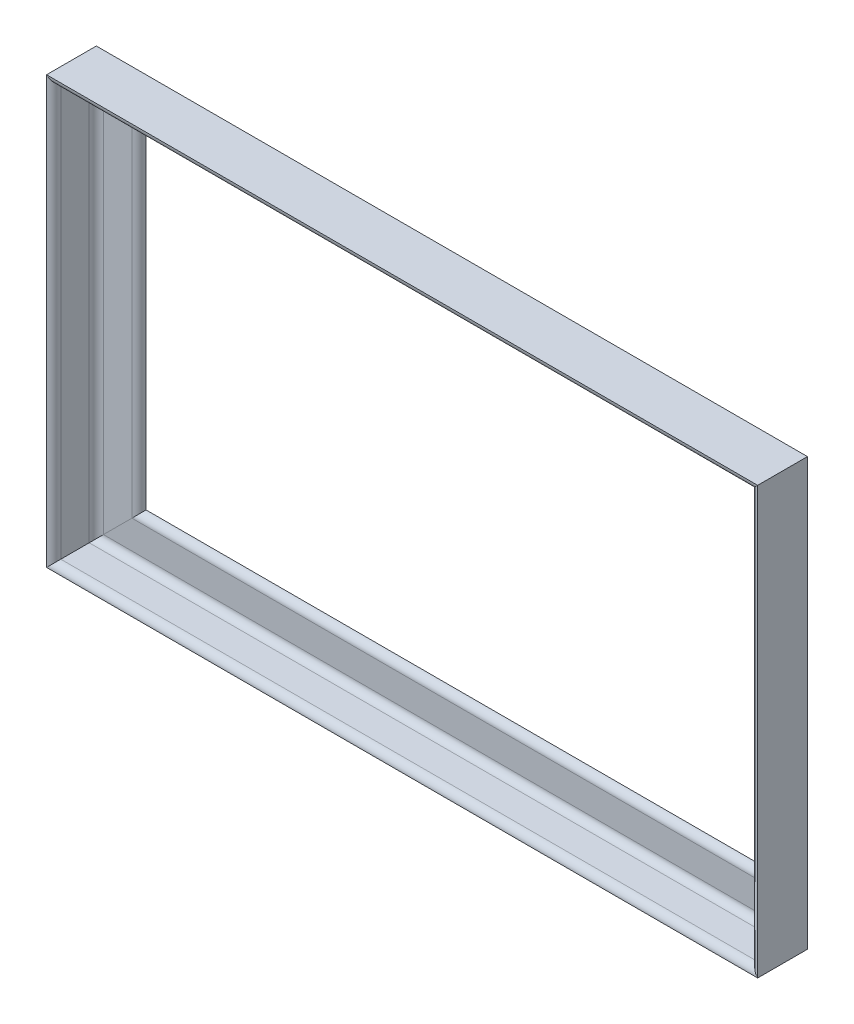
from build123d import *

# Parameters (mm, degrees)
K_TOWNIK_STALOWY_35_X_35_X_5_1_DEPTH      = 50.497474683
K_TOWNIK_STALOWY_35_X_35_X_5_1_DEPTH_BACK = 550.497474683
K_TOWNIK_STALOWY_35_X_35_X_5_1_2_DEPTH    = 400.994949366
K_TOWNIK_STALOWY_35_X_35_X_5_1_3_DEPTH    = 600.994949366
K_TOWNIK_STALOWY_35_X_35_X_5_1_4_DEPTH    = 400.994949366


with BuildPart() as part:
    # Sketch1 → K_townik stalowy 35 X 35 X 5_1 (new, two sides: drawn at the far end of the back side and taken through both)
    with BuildSketch(Plane(origin=(250, -150, 0), x_dir=(0, 1, 0), z_dir=(1, 0, 0)).offset(-K_TOWNIK_STALOWY_35_X_35_X_5_1_DEPTH_BACK)):
        with BuildLine():
            Line((0, 0), (0, 35))
            ThreePointArc((0, 35), (3.535533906, 33.535533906), (5, 30))
            Line((5, 30), (5, 10))
            ThreePointArc((5, 10), (6.464466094, 6.464466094), (10, 5))
            Line((10, 5), (30, 5))
            ThreePointArc((30, 5), (33.535533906, 3.535533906), (35, 0))
            Line((35, 0), (0, 0))
        make_face()
    extrude(amount=K_TOWNIK_STALOWY_35_X_35_X_5_1_DEPTH + K_TOWNIK_STALOWY_35_X_35_X_5_1_DEPTH_BACK)

    # K_townik stalowy 35 X 35 X 5_1 mitre 1
    split(bisect_by=Plane(origin=(250, -150, 0), x_dir=(0.707106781, -0.707106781, 0), z_dir=(-0.707106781, -0.707106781, 0)), keep=Keep.TOP)

    # K_townik stalowy 35 X 35 X 5_1 mitre 2
    split(bisect_by=Plane(origin=(-250, -150, 0), x_dir=(0.707106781, 0.707106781, 0), z_dir=(0.707106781, -0.707106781, 0)), keep=Keep.TOP)


with BuildPart() as body_2:
    # Sketch1 on segment 2 (on carried to segment 2) → K_townik stalowy 35 X 35 X 5_1 2 (new body)
    with BuildSketch(Plane(origin=(-250, 200.497474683, 0), x_dir=(1, 0, 0), z_dir=(0, -1, 0))):
        with BuildLine():
            Line((0, 0), (0, 35))
            ThreePointArc((0, 35), (3.535533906, 33.535533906), (5, 30))
            Line((5, 30), (5, 10))
            ThreePointArc((5, 10), (6.464466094, 6.464466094), (10, 5))
            Line((10, 5), (30, 5))
            ThreePointArc((30, 5), (33.535533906, 3.535533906), (35, 0))
            Line((35, 0), (0, 0))
        make_face()
    extrude(amount=K_TOWNIK_STALOWY_35_X_35_X_5_1_2_DEPTH)

    # K_townik stalowy 35 X 35 X 5_1 2 mitre 1
    split(bisect_by=Plane(origin=(-250, -150, 0), x_dir=(-0.707106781, -0.707106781, 0), z_dir=(-0.707106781, 0.707106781, 0)), keep=Keep.TOP)

    # K_townik stalowy 35 X 35 X 5_1 2 mitre 2
    split(bisect_by=Plane(origin=(-250, 150, 0), x_dir=(0.707106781, -0.707106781, 0), z_dir=(-0.707106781, -0.707106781, 0)), keep=Keep.TOP)


with BuildPart() as body_3:
    # Sketch1 on segment 3 (on carried to segment 3) → K_townik stalowy 35 X 35 X 5_1 3 (new body)
    with BuildSketch(Plane(origin=(300.497474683, 150, 0), x_dir=(0, -1, 0), z_dir=(-1, 0, 0))):
        with BuildLine():
            Line((0, 0), (0, 35))
            ThreePointArc((0, 35), (3.535533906, 33.535533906), (5, 30))
            Line((5, 30), (5, 10))
            ThreePointArc((5, 10), (6.464466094, 6.464466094), (10, 5))
            Line((10, 5), (30, 5))
            ThreePointArc((30, 5), (33.535533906, 3.535533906), (35, 0))
            Line((35, 0), (0, 0))
        make_face()
    extrude(amount=K_TOWNIK_STALOWY_35_X_35_X_5_1_3_DEPTH)

    # K_townik stalowy 35 X 35 X 5_1 3 mitre 1
    split(bisect_by=Plane(origin=(250, 150, 0), x_dir=(-0.707106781, -0.707106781, 0), z_dir=(-0.707106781, 0.707106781, 0)), keep=Keep.TOP)

    # K_townik stalowy 35 X 35 X 5_1 3 mitre 2
    split(bisect_by=Plane(origin=(-250, 150, 0), x_dir=(-0.707106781, 0.707106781, 0), z_dir=(0.707106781, 0.707106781, 0)), keep=Keep.TOP)


with BuildPart() as body_4:
    # Sketch1 on segment 4 (on carried to segment 4) → K_townik stalowy 35 X 35 X 5_1 4 (new body)
    with BuildSketch(Plane(origin=(250, -200.497474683, 0), x_dir=(-1, 0, 0), z_dir=(0, 1, 0))):
        with BuildLine():
            Line((0, 0), (0, 35))
            ThreePointArc((0, 35), (3.535533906, 33.535533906), (5, 30))
            Line((5, 30), (5, 10))
            ThreePointArc((5, 10), (6.464466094, 6.464466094), (10, 5))
            Line((10, 5), (30, 5))
            ThreePointArc((30, 5), (33.535533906, 3.535533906), (35, 0))
            Line((35, 0), (0, 0))
        make_face()
    extrude(amount=K_TOWNIK_STALOWY_35_X_35_X_5_1_4_DEPTH)

    # K_townik stalowy 35 X 35 X 5_1 4 mitre 1
    split(bisect_by=Plane(origin=(250, -150, 0), x_dir=(-0.707106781, 0.707106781, 0), z_dir=(0.707106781, 0.707106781, 0)), keep=Keep.TOP)

    # K_townik stalowy 35 X 35 X 5_1 4 mitre 2
    split(bisect_by=Plane(origin=(250, 150, 0), x_dir=(0.707106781, 0.707106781, 0), z_dir=(0.707106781, -0.707106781, 0)), keep=Keep.TOP)


solid = Compound([part.part, body_2.part, body_3.part, body_4.part])
